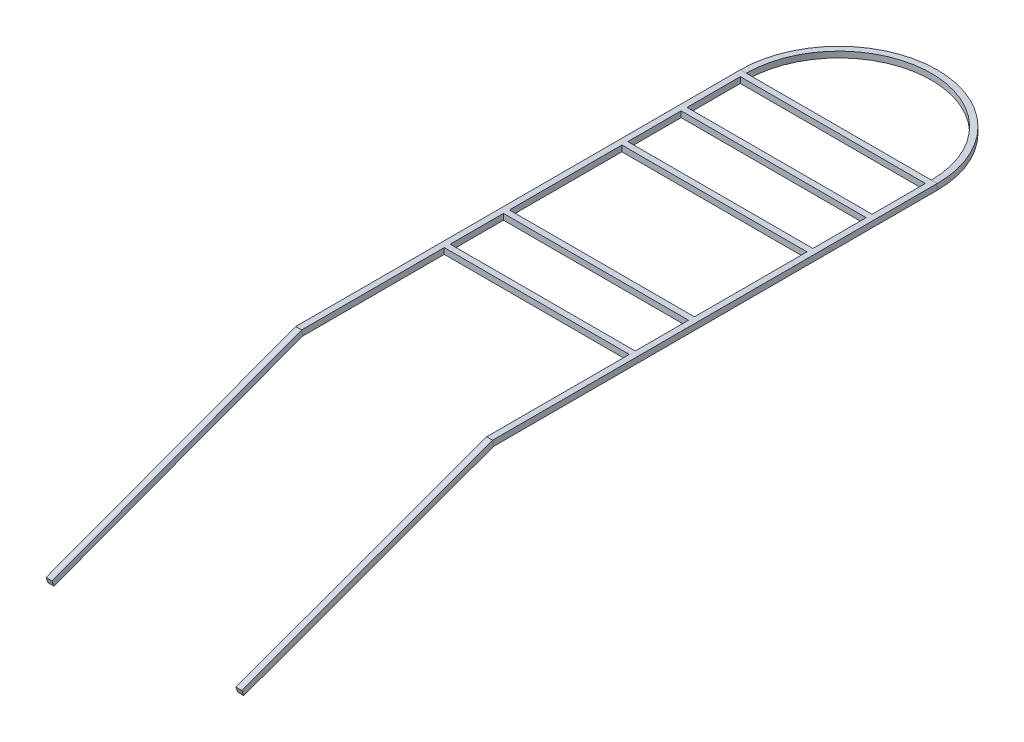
ISO-10303-21;
HEADER;
FILE_DESCRIPTION(('STEP AP214'),'2;1');
FILE_NAME('part.step','',(''),(''),'','','');
FILE_SCHEMA(('AUTOMOTIVE_DESIGN { 1 0 10303 214 1 1 1 1 }'));
ENDSEC;
DATA;
#1=APPLICATION_CONTEXT('core data for automotive mechanical design processes');
#2=APPLICATION_PROTOCOL_DEFINITION('international standard','automotive_design',2000,#1);
#3=PRODUCT_CONTEXT('',#1,'mechanical');
#4=PRODUCT('Part','Part','',(#3));
#5=PRODUCT_RELATED_PRODUCT_CATEGORY('part','',(#4));
#6=PRODUCT_DEFINITION_FORMATION('','',#4);
#7=PRODUCT_DEFINITION_CONTEXT('part definition',#1,'design');
#8=PRODUCT_DEFINITION('design','',#6,#7);
#9=PRODUCT_DEFINITION_SHAPE('','',#8);
#10=(LENGTH_UNIT() NAMED_UNIT(*) SI_UNIT(.MILLI.,.METRE.));
#11=(NAMED_UNIT(*) PLANE_ANGLE_UNIT() SI_UNIT($,.RADIAN.));
#12=(NAMED_UNIT(*) SI_UNIT($,.STERADIAN.) SOLID_ANGLE_UNIT());
#13=UNCERTAINTY_MEASURE_WITH_UNIT(LENGTH_MEASURE(1.E-05),#10,'distance_accuracy_value','');
#14=(GEOMETRIC_REPRESENTATION_CONTEXT(3) GLOBAL_UNCERTAINTY_ASSIGNED_CONTEXT((#13)) GLOBAL_UNIT_ASSIGNED_CONTEXT((#10,
#11,#12)) REPRESENTATION_CONTEXT('',''));
#15=CARTESIAN_POINT('',(0.,0.,0.));
#16=DIRECTION('',(0.,0.,1.));
#17=DIRECTION('',(1.,0.,0.));
#18=AXIS2_PLACEMENT_3D('',#15,#16,#17);
#19=CARTESIAN_POINT('',(-127.,-2.00000000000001,0.493089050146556));
#20=DIRECTION('',(1.,0.,0.));
#21=DIRECTION('',(0.,0.,-1.));
#22=AXIS2_PLACEMENT_3D('',#19,#20,#21);
#23=PLANE('',#22);
#24=DIRECTION('',(0.,0.,-1.));
#25=VECTOR('',#24,1.);
#26=CARTESIAN_POINT('',(-127.,-2.00000000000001,0.493089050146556));
#27=LINE('',#26,#25);
#28=CARTESIAN_POINT('',(-127.,-2.00000000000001,-0.357353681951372));
#29=VERTEX_POINT('',#28);
#30=CARTESIAN_POINT('',(-127.,-2.00000000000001,-95.9999999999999));
#31=VERTEX_POINT('',#30);
#32=EDGE_CURVE('E405',#29,#31,#27,.T.);
#33=ORIENTED_EDGE('',*,*,#32,.T.);
#34=DIRECTION('',(0.,-1.,0.));
#35=VECTOR('',#34,1.);
#36=CARTESIAN_POINT('',(-127.,-2.,-95.9999999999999));
#37=LINE('',#36,#35);
#38=CARTESIAN_POINT('',(-127.,2.,-95.9999999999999));
#39=VERTEX_POINT('',#38);
#40=EDGE_CURVE('E261',#39,#31,#37,.T.);
#41=ORIENTED_EDGE('',*,*,#40,.F.);
#42=DIRECTION('',(0.,0.,-1.));
#43=VECTOR('',#42,1.);
#44=CARTESIAN_POINT('',(-127.,2.,0.493089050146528));
#45=LINE('',#44,#43);
#46=CARTESIAN_POINT('',(-127.,2.,0.347950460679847));
#47=VERTEX_POINT('',#46);
#48=EDGE_CURVE('E400',#47,#39,#45,.T.);
#49=ORIENTED_EDGE('',*,*,#48,.F.);
#50=DIRECTION('',(0.,0.984807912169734,0.173647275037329));
#51=VECTOR('',#50,1.);
#52=CARTESIAN_POINT('',(-127.,-32.7208671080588,-5.77424239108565));
#53=LINE('',#52,#51);
#54=EDGE_CURVE('E48',#29,#47,#53,.T.);
#55=ORIENTED_EDGE('',*,*,#54,.F.);
#56=EDGE_LOOP('',(#33,#41,#49,#55));
#57=FACE_BOUND('',#56,.T.);
#58=ADVANCED_FACE('F39',(#57),#23,.T.);
#59=CARTESIAN_POINT('',(-127.,2.,-99.9999999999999));
#60=VERTEX_POINT('',#59);
#61=CARTESIAN_POINT('',(-127.,2.,-136.));
#62=VERTEX_POINT('',#61);
#63=EDGE_CURVE('E404',#60,#62,#45,.T.);
#64=ORIENTED_EDGE('',*,*,#63,.F.);
#65=DIRECTION('',(0.,1.,0.));
#66=VECTOR('',#65,1.);
#67=CARTESIAN_POINT('',(-127.,-2.,-99.9999999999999));
#68=LINE('',#67,#66);
#69=CARTESIAN_POINT('',(-127.,-2.,-99.9999999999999));
#70=VERTEX_POINT('',#69);
#71=EDGE_CURVE('E282',#70,#60,#68,.T.);
#72=ORIENTED_EDGE('',*,*,#71,.F.);
#73=CARTESIAN_POINT('',(-127.,-2.00000000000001,-136.));
#74=VERTEX_POINT('',#73);
#75=EDGE_CURVE('E408',#70,#74,#27,.T.);
#76=ORIENTED_EDGE('',*,*,#75,.T.);
#77=DIRECTION('',(0.,-1.,0.));
#78=VECTOR('',#77,1.);
#79=CARTESIAN_POINT('',(-127.,-2.,-136.));
#80=LINE('',#79,#78);
#81=EDGE_CURVE('E270',#62,#74,#80,.T.);
#82=ORIENTED_EDGE('',*,*,#81,.F.);
#83=EDGE_LOOP('',(#64,#72,#76,#82));
#84=FACE_BOUND('',#83,.T.);
#85=ADVANCED_FACE('F529',(#84),#23,.T.);
#86=CARTESIAN_POINT('',(-2.,-2.00000000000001,-300.));
#87=DIRECTION('',(-1.,0.,0.));
#88=DIRECTION('',(0.,-1.,0.));
#89=AXIS2_PLACEMENT_3D('',#86,#87,#88);
#90=PLANE('',#89);
#91=DIRECTION('',(0.,0.,1.));
#92=VECTOR('',#91,1.);
#93=CARTESIAN_POINT('',(-2.,2.,-300.));
#94=LINE('',#93,#92);
#95=CARTESIAN_POINT('',(-2.,2.,-95.9999999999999));
#96=VERTEX_POINT('',#95);
#97=CARTESIAN_POINT('',(-2.,2.,0.352653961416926));
#98=VERTEX_POINT('',#97);
#99=EDGE_CURVE('E56',#96,#98,#94,.T.);
#100=ORIENTED_EDGE('',*,*,#99,.F.);
#101=DIRECTION('',(0.,1.,0.));
#102=VECTOR('',#101,1.);
#103=CARTESIAN_POINT('',(-2.00000000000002,-2.,-95.9999999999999));
#104=LINE('',#103,#102);
#105=CARTESIAN_POINT('',(-2.00000000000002,-2.,-95.9999999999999));
#106=VERTEX_POINT('',#105);
#107=EDGE_CURVE('E254',#106,#96,#104,.T.);
#108=ORIENTED_EDGE('',*,*,#107,.F.);
#109=DIRECTION('',(0.,0.,1.));
#110=VECTOR('',#109,1.);
#111=CARTESIAN_POINT('',(-2.,-2.00000000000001,-300.));
#112=LINE('',#111,#110);
#113=CARTESIAN_POINT('',(-2.,-2.00000000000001,-0.352653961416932));
#114=VERTEX_POINT('',#113);
#115=EDGE_CURVE('E239',#106,#114,#112,.T.);
#116=ORIENTED_EDGE('',*,*,#115,.T.);
#117=DIRECTION('',(0.,0.984807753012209,0.173648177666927));
#118=VECTOR('',#117,1.);
#119=CARTESIAN_POINT('',(-2.,-53.2427141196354,-9.38812702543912));
#120=LINE('',#119,#118);
#121=EDGE_CURVE('E448',#114,#98,#120,.T.);
#122=ORIENTED_EDGE('',*,*,#121,.T.);
#123=EDGE_LOOP('',(#100,#108,#116,#122));
#124=FACE_BOUND('',#123,.T.);
#125=ADVANCED_FACE('F255',(#124),#90,.T.);
#126=CARTESIAN_POINT('',(-2.00000000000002,-2.,-136.));
#127=VERTEX_POINT('',#126);
#128=CARTESIAN_POINT('',(-2.,-2.00000000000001,-99.9999999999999));
#129=VERTEX_POINT('',#128);
#130=EDGE_CURVE('E249',#127,#129,#112,.T.);
#131=ORIENTED_EDGE('',*,*,#130,.T.);
#132=DIRECTION('',(0.,-1.,0.));
#133=VECTOR('',#132,1.);
#134=CARTESIAN_POINT('',(-2.00000000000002,-2.,-99.9999999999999));
#135=LINE('',#134,#133);
#136=CARTESIAN_POINT('',(-2.,2.,-99.9999999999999));
#137=VERTEX_POINT('',#136);
#138=EDGE_CURVE('E64',#137,#129,#135,.T.);
#139=ORIENTED_EDGE('',*,*,#138,.F.);
#140=CARTESIAN_POINT('',(-2.,2.,-136.));
#141=VERTEX_POINT('',#140);
#142=EDGE_CURVE('E579',#141,#137,#94,.T.);
#143=ORIENTED_EDGE('',*,*,#142,.F.);
#144=DIRECTION('',(0.,1.,0.));
#145=VECTOR('',#144,1.);
#146=CARTESIAN_POINT('',(-2.00000000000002,-2.,-136.));
#147=LINE('',#146,#145);
#148=EDGE_CURVE('E281',#127,#141,#147,.T.);
#149=ORIENTED_EDGE('',*,*,#148,.F.);
#150=EDGE_LOOP('',(#131,#139,#143,#149));
#151=FACE_BOUND('',#150,.T.);
#152=ADVANCED_FACE('F559',(#151),#90,.T.);
#153=CARTESIAN_POINT('',(-127.,2.,-140.));
#154=VERTEX_POINT('',#153);
#155=CARTESIAN_POINT('',(-127.,2.,-216.));
#156=VERTEX_POINT('',#155);
#157=EDGE_CURVE('E567',#154,#156,#45,.T.);
#158=ORIENTED_EDGE('',*,*,#157,.F.);
#159=DIRECTION('',(0.,1.,0.));
#160=VECTOR('',#159,1.);
#161=CARTESIAN_POINT('',(-127.,-2.,-140.));
#162=LINE('',#161,#160);
#163=CARTESIAN_POINT('',(-127.,-2.,-140.));
#164=VERTEX_POINT('',#163);
#165=EDGE_CURVE('E273',#164,#154,#162,.T.);
#166=ORIENTED_EDGE('',*,*,#165,.F.);
#167=CARTESIAN_POINT('',(-127.,-2.00000000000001,-216.));
#168=VERTEX_POINT('',#167);
#169=EDGE_CURVE('E900',#164,#168,#27,.T.);
#170=ORIENTED_EDGE('',*,*,#169,.T.);
#171=DIRECTION('',(0.,-1.,0.));
#172=VECTOR('',#171,1.);
#173=CARTESIAN_POINT('',(-127.,-2.,-216.));
#174=LINE('',#173,#172);
#175=EDGE_CURVE('E296',#156,#168,#174,.T.);
#176=ORIENTED_EDGE('',*,*,#175,.F.);
#177=EDGE_LOOP('',(#158,#166,#170,#176));
#178=FACE_BOUND('',#177,.T.);
#179=ADVANCED_FACE('F537',(#178),#23,.T.);
#180=CARTESIAN_POINT('',(-2.00000000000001,-2.,-216.));
#181=VERTEX_POINT('',#180);
#182=CARTESIAN_POINT('',(-2.,-2.00000000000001,-140.));
#183=VERTEX_POINT('',#182);
#184=EDGE_CURVE('E905',#181,#183,#112,.T.);
#185=ORIENTED_EDGE('',*,*,#184,.T.);
#186=DIRECTION('',(0.,-1.,0.));
#187=VECTOR('',#186,1.);
#188=CARTESIAN_POINT('',(-2.00000000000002,-2.,-140.));
#189=LINE('',#188,#187);
#190=CARTESIAN_POINT('',(-2.,2.,-140.));
#191=VERTEX_POINT('',#190);
#192=EDGE_CURVE('E278',#191,#183,#189,.T.);
#193=ORIENTED_EDGE('',*,*,#192,.F.);
#194=CARTESIAN_POINT('',(-2.,2.,-216.));
#195=VERTEX_POINT('',#194);
#196=EDGE_CURVE('E577',#195,#191,#94,.T.);
#197=ORIENTED_EDGE('',*,*,#196,.F.);
#198=DIRECTION('',(0.,1.,0.));
#199=VECTOR('',#198,1.);
#200=CARTESIAN_POINT('',(-2.00000000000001,-2.,-216.));
#201=LINE('',#200,#199);
#202=EDGE_CURVE('E306',#181,#195,#201,.T.);
#203=ORIENTED_EDGE('',*,*,#202,.F.);
#204=EDGE_LOOP('',(#185,#193,#197,#203));
#205=FACE_BOUND('',#204,.T.);
#206=ADVANCED_FACE('F552',(#205),#90,.T.);
#207=CARTESIAN_POINT('',(-127.,2.,-220.));
#208=VERTEX_POINT('',#207);
#209=CARTESIAN_POINT('',(-127.,2.,-256.));
#210=VERTEX_POINT('',#209);
#211=EDGE_CURVE('E572',#208,#210,#45,.T.);
#212=ORIENTED_EDGE('',*,*,#211,.F.);
#213=DIRECTION('',(0.,1.,0.));
#214=VECTOR('',#213,1.);
#215=CARTESIAN_POINT('',(-127.,-2.,-220.));
#216=LINE('',#215,#214);
#217=CARTESIAN_POINT('',(-127.,-2.,-220.));
#218=VERTEX_POINT('',#217);
#219=EDGE_CURVE('E299',#218,#208,#216,.T.);
#220=ORIENTED_EDGE('',*,*,#219,.F.);
#221=CARTESIAN_POINT('',(-127.,-2.00000000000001,-256.));
#222=VERTEX_POINT('',#221);
#223=EDGE_CURVE('E911',#218,#222,#27,.T.);
#224=ORIENTED_EDGE('',*,*,#223,.T.);
#225=DIRECTION('',(0.,-1.,0.));
#226=VECTOR('',#225,1.);
#227=CARTESIAN_POINT('',(-127.,-1.99999999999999,-256.));
#228=LINE('',#227,#226);
#229=EDGE_CURVE('E320',#210,#222,#228,.T.);
#230=ORIENTED_EDGE('',*,*,#229,.F.);
#231=EDGE_LOOP('',(#212,#220,#224,#230));
#232=FACE_BOUND('',#231,.T.);
#233=ADVANCED_FACE('F544',(#232),#23,.T.);
#234=CARTESIAN_POINT('',(-2.,-2.,-256.));
#235=VERTEX_POINT('',#234);
#236=CARTESIAN_POINT('',(-2.,-2.00000000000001,-220.));
#237=VERTEX_POINT('',#236);
#238=EDGE_CURVE('E460',#235,#237,#112,.T.);
#239=ORIENTED_EDGE('',*,*,#238,.T.);
#240=DIRECTION('',(0.,-1.,0.));
#241=VECTOR('',#240,1.);
#242=CARTESIAN_POINT('',(-2.00000000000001,-2.,-220.));
#243=LINE('',#242,#241);
#244=CARTESIAN_POINT('',(-2.,2.,-220.));
#245=VERTEX_POINT('',#244);
#246=EDGE_CURVE('E277',#245,#237,#243,.T.);
#247=ORIENTED_EDGE('',*,*,#246,.F.);
#248=CARTESIAN_POINT('',(-2.,2.,-256.));
#249=VERTEX_POINT('',#248);
#250=EDGE_CURVE('E458',#249,#245,#94,.T.);
#251=ORIENTED_EDGE('',*,*,#250,.F.);
#252=DIRECTION('',(0.,1.,0.));
#253=VECTOR('',#252,1.);
#254=CARTESIAN_POINT('',(-2.,-2.,-256.));
#255=LINE('',#254,#253);
#256=EDGE_CURVE('E330',#235,#249,#255,.T.);
#257=ORIENTED_EDGE('',*,*,#256,.F.);
#258=EDGE_LOOP('',(#239,#247,#251,#257));
#259=FACE_BOUND('',#258,.T.);
#260=ADVANCED_FACE('F542',(#259),#90,.T.);
#261=CARTESIAN_POINT('',(-127.,2.,-260.));
#262=VERTEX_POINT('',#261);
#263=CARTESIAN_POINT('',(-127.,2.00000000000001,-296.));
#264=VERTEX_POINT('',#263);
#265=EDGE_CURVE('E399',#262,#264,#45,.T.);
#266=ORIENTED_EDGE('',*,*,#265,.F.);
#267=DIRECTION('',(0.,1.,0.));
#268=VECTOR('',#267,1.);
#269=CARTESIAN_POINT('',(-127.,-2.,-260.));
#270=LINE('',#269,#268);
#271=CARTESIAN_POINT('',(-127.,-2.,-260.));
#272=VERTEX_POINT('',#271);
#273=EDGE_CURVE('E323',#272,#262,#270,.T.);
#274=ORIENTED_EDGE('',*,*,#273,.F.);
#275=CARTESIAN_POINT('',(-127.,-2.,-296.));
#276=VERTEX_POINT('',#275);
#277=EDGE_CURVE('E403',#272,#276,#27,.T.);
#278=ORIENTED_EDGE('',*,*,#277,.T.);
#279=DIRECTION('',(0.,-1.,0.));
#280=VECTOR('',#279,1.);
#281=CARTESIAN_POINT('',(-127.,-1.99999999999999,-296.));
#282=LINE('',#281,#280);
#283=EDGE_CURVE('E344',#264,#276,#282,.T.);
#284=ORIENTED_EDGE('',*,*,#283,.F.);
#285=EDGE_LOOP('',(#266,#274,#278,#284));
#286=FACE_BOUND('',#285,.T.);
#287=ADVANCED_FACE('F532',(#286),#23,.T.);
#288=CARTESIAN_POINT('',(-2.,-2.,-296.));
#289=VERTEX_POINT('',#288);
#290=CARTESIAN_POINT('',(-2.,-2.00000000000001,-260.));
#291=VERTEX_POINT('',#290);
#292=EDGE_CURVE('E252',#289,#291,#112,.T.);
#293=ORIENTED_EDGE('',*,*,#292,.T.);
#294=DIRECTION('',(0.,-1.,0.));
#295=VECTOR('',#294,1.);
#296=CARTESIAN_POINT('',(-2.,-2.,-260.));
#297=LINE('',#296,#295);
#298=CARTESIAN_POINT('',(-2.,2.,-260.));
#299=VERTEX_POINT('',#298);
#300=EDGE_CURVE('E303',#299,#291,#297,.T.);
#301=ORIENTED_EDGE('',*,*,#300,.F.);
#302=CARTESIAN_POINT('',(-2.,2.,-296.));
#303=VERTEX_POINT('',#302);
#304=EDGE_CURVE('E250',#303,#299,#94,.T.);
#305=ORIENTED_EDGE('',*,*,#304,.F.);
#306=DIRECTION('',(0.,1.,0.));
#307=VECTOR('',#306,1.);
#308=CARTESIAN_POINT('',(-2.,-2.,-296.));
#309=LINE('',#308,#307);
#310=EDGE_CURVE('E327',#289,#303,#309,.T.);
#311=ORIENTED_EDGE('',*,*,#310,.F.);
#312=EDGE_LOOP('',(#293,#301,#305,#311));
#313=FACE_BOUND('',#312,.T.);
#314=ADVANCED_FACE('F541',(#313),#90,.T.);
#315=CARTESIAN_POINT('',(0.,-61.5636257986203,169.144671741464));
#316=DIRECTION('',(0.,0.342020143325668,-0.939692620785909));
#317=DIRECTION('',(0.,0.939692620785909,0.342020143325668));
#318=AXIS2_PLACEMENT_3D('',#315,#316,#317);
#319=PLANE('',#318);
#320=DIRECTION('',(0.,0.939692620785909,0.342020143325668));
#321=VECTOR('',#320,1.);
#322=CARTESIAN_POINT('',(1.99999999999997,-63.4430110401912,168.460631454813));
#323=LINE('',#322,#321);
#324=CARTESIAN_POINT('',(1.99999999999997,-63.4430110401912,168.460631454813));
#325=VERTEX_POINT('',#324);
#326=CARTESIAN_POINT('',(1.99999999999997,-59.6842405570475,169.828712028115));
#327=VERTEX_POINT('',#326);
#328=EDGE_CURVE('E466',#325,#327,#323,.T.);
#329=ORIENTED_EDGE('',*,*,#328,.T.);
#330=DIRECTION('',(-1.,0.,0.));
#331=VECTOR('',#330,1.);
#332=CARTESIAN_POINT('',(-2.00000000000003,-59.6842405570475,169.828712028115));
#333=LINE('',#332,#331);
#334=CARTESIAN_POINT('',(-2.00000000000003,-59.6842405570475,169.828712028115));
#335=VERTEX_POINT('',#334);
#336=EDGE_CURVE('E464',#327,#335,#333,.T.);
#337=ORIENTED_EDGE('',*,*,#336,.T.);
#338=DIRECTION('',(0.,-0.939692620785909,-0.342020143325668));
#339=VECTOR('',#338,1.);
#340=CARTESIAN_POINT('',(-2.00000000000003,-63.4430110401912,168.460631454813));
#341=LINE('',#340,#339);
#342=CARTESIAN_POINT('',(-2.00000000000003,-63.4430110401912,168.460631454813));
#343=VERTEX_POINT('',#342);
#344=EDGE_CURVE('E462',#335,#343,#341,.T.);
#345=ORIENTED_EDGE('',*,*,#344,.T.);
#346=DIRECTION('',(1.,0.,0.));
#347=VECTOR('',#346,1.);
#348=CARTESIAN_POINT('',(-2.00000000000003,-63.4430110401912,168.460631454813));
#349=LINE('',#348,#347);
#350=EDGE_CURVE('E347',#343,#325,#349,.T.);
#351=ORIENTED_EDGE('',*,*,#350,.T.);
#352=EDGE_LOOP('',(#329,#337,#345,#351));
#353=FACE_BOUND('',#352,.T.);
#354=ADVANCED_FACE('F41',(#353),#319,.F.);
#355=CARTESIAN_POINT('',(-128.179224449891,-61.5636257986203,169.144671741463));
#356=DIRECTION('',(0.00455981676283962,-0.342016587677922,0.939682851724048));
#357=DIRECTION('',(0.000804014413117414,0.939693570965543,0.342016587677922));
#358=AXIS2_PLACEMENT_3D('',#355,#356,#357);
#359=PLANE('',#358);
#360=DIRECTION('',(0.000804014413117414,0.939693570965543,0.342016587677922));
#361=VECTOR('',#360,1.);
#362=CARTESIAN_POINT('',(-130.180811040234,-63.4446209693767,168.469758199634));
#363=LINE('',#362,#361);
#364=CARTESIAN_POINT('',(-130.180811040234,-63.4446209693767,168.469758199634));
#365=VERTEX_POINT('',#364);
#366=CARTESIAN_POINT('',(-130.177594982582,-59.6858466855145,169.837824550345));
#367=VERTEX_POINT('',#366);
#368=EDGE_CURVE('E368',#365,#367,#363,.T.);
#369=ORIENTED_EDGE('',*,*,#368,.F.);
#370=DIRECTION('',(-0.999989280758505,-0.000804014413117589,0.00455981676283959));
#371=VECTOR('',#370,1.);
#372=CARTESIAN_POINT('',(-126.1808539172,-63.4414049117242,168.451518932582));
#373=LINE('',#372,#371);
#374=CARTESIAN_POINT('',(-126.1808539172,-63.4414049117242,168.451518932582));
#375=VERTEX_POINT('',#374);
#376=EDGE_CURVE('E379',#375,#365,#373,.T.);
#377=ORIENTED_EDGE('',*,*,#376,.F.);
#378=DIRECTION('',(-0.000804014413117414,-0.939693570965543,-0.342016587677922));
#379=VECTOR('',#378,1.);
#380=CARTESIAN_POINT('',(-126.1808539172,-63.4414049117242,168.451518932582));
#381=LINE('',#380,#379);
#382=CARTESIAN_POINT('',(-126.177637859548,-59.682630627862,169.819585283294));
#383=VERTEX_POINT('',#382);
#384=EDGE_CURVE('E382',#383,#375,#381,.T.);
#385=ORIENTED_EDGE('',*,*,#384,.F.);
#386=DIRECTION('',(0.999989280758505,0.000804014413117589,-0.00455981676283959));
#387=VECTOR('',#386,1.);
#388=CARTESIAN_POINT('',(-126.177637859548,-59.682630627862,169.819585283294));
#389=LINE('',#388,#387);
#390=EDGE_CURVE('E371',#367,#383,#389,.T.);
#391=ORIENTED_EDGE('',*,*,#390,.F.);
#392=EDGE_LOOP('',(#369,#377,#385,#391));
#393=FACE_BOUND('',#392,.T.);
#394=ADVANCED_FACE('F594',(#393),#359,.T.);
#395=CARTESIAN_POINT('',(2.,-1.71250699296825,-1.1425345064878));
#396=DIRECTION('',(1.,0.,0.));
#397=DIRECTION('',(0.,0.,-1.));
#398=AXIS2_PLACEMENT_3D('',#395,#396,#397);
#399=PLANE('',#398);
#400=DIRECTION('',(0.,-0.984807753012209,-0.173648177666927));
#401=VECTOR('',#400,1.);
#402=CARTESIAN_POINT('',(2.,-53.2427141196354,-9.38812702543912));
#403=LINE('',#402,#401);
#404=CARTESIAN_POINT('',(2.,2.,0.352653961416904));
#405=VERTEX_POINT('',#404);
#406=CARTESIAN_POINT('',(2.,-2.00000000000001,-0.352653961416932));
#407=VERTEX_POINT('',#406);
#408=EDGE_CURVE('E397',#405,#407,#403,.T.);
#409=ORIENTED_EDGE('',*,*,#408,.F.);
#410=DIRECTION('',(0.,-0.342020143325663,0.93969262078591));
#411=VECTOR('',#410,1.);
#412=CARTESIAN_POINT('',(2.,2.04626349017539,0.22554606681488));
#413=LINE('',#412,#411);
#414=EDGE_CURVE('E473',#405,#327,#413,.T.);
#415=ORIENTED_EDGE('',*,*,#414,.T.);
#416=ORIENTED_EDGE('',*,*,#328,.F.);
#417=DIRECTION('',(0.,-0.342020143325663,0.93969262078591));
#418=VECTOR('',#417,1.);
#419=CARTESIAN_POINT('',(2.,-1.71250699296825,-1.1425345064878));
#420=LINE('',#419,#418);
#421=EDGE_CURVE('E43',#407,#325,#420,.T.);
#422=ORIENTED_EDGE('',*,*,#421,.F.);
#423=EDGE_LOOP('',(#409,#415,#416,#422));
#424=FACE_BOUND('',#423,.T.);
#425=ADVANCED_FACE('F484',(#424),#399,.T.);
#426=CARTESIAN_POINT('',(-2.,2.04626349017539,0.22554606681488));
#427=DIRECTION('',(0.,0.939692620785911,0.342020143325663));
#428=DIRECTION('',(0.,-0.342020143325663,0.939692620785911));
#429=AXIS2_PLACEMENT_3D('',#426,#427,#428);
#430=PLANE('',#429);
#431=DIRECTION('',(1.,0.,0.));
#432=VECTOR('',#431,1.);
#433=CARTESIAN_POINT('',(-2.00000000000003,2.,0.352653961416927));
#434=LINE('',#433,#432);
#435=EDGE_CURVE('E450',#98,#405,#434,.T.);
#436=ORIENTED_EDGE('',*,*,#435,.F.);
#437=DIRECTION('',(0.,-0.342020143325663,0.93969262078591));
#438=VECTOR('',#437,1.);
#439=CARTESIAN_POINT('',(-2.,2.04626349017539,0.22554606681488));
#440=LINE('',#439,#438);
#441=EDGE_CURVE('E471',#98,#335,#440,.T.);
#442=ORIENTED_EDGE('',*,*,#441,.T.);
#443=ORIENTED_EDGE('',*,*,#336,.F.);
#444=ORIENTED_EDGE('',*,*,#414,.F.);
#445=EDGE_LOOP('',(#436,#442,#443,#444));
#446=FACE_BOUND('',#445,.T.);
#447=ADVANCED_FACE('F587',(#446),#430,.T.);
#448=CARTESIAN_POINT('',(-2.,-1.71250699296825,-1.1425345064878));
#449=DIRECTION('',(-1.,0.,0.));
#450=DIRECTION('',(0.,0.,1.));
#451=AXIS2_PLACEMENT_3D('',#448,#449,#450);
#452=PLANE('',#451);
#453=ORIENTED_EDGE('',*,*,#121,.F.);
#454=DIRECTION('',(0.,-0.342020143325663,0.93969262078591));
#455=VECTOR('',#454,1.);
#456=CARTESIAN_POINT('',(-2.,-1.71250699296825,-1.1425345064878));
#457=LINE('',#456,#455);
#458=EDGE_CURVE('E468',#114,#343,#457,.T.);
#459=ORIENTED_EDGE('',*,*,#458,.T.);
#460=ORIENTED_EDGE('',*,*,#344,.F.);
#461=ORIENTED_EDGE('',*,*,#441,.F.);
#462=EDGE_LOOP('',(#453,#459,#460,#461));
#463=FACE_BOUND('',#462,.T.);
#464=ADVANCED_FACE('F591',(#463),#452,.T.);
#465=CARTESIAN_POINT('',(-2.,-1.71250699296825,-1.1425345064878));
#466=DIRECTION('',(0.,-0.939692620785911,-0.342020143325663));
#467=DIRECTION('',(0.,0.342020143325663,-0.939692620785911));
#468=AXIS2_PLACEMENT_3D('',#465,#466,#467);
#469=PLANE('',#468);
#470=DIRECTION('',(-1.,0.,0.));
#471=VECTOR('',#470,1.);
#472=CARTESIAN_POINT('',(-2.00000000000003,-2.00000000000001,-0.352653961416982));
#473=LINE('',#472,#471);
#474=EDGE_CURVE('E247',#407,#114,#473,.T.);
#475=ORIENTED_EDGE('',*,*,#474,.F.);
#476=ORIENTED_EDGE('',*,*,#421,.T.);
#477=ORIENTED_EDGE('',*,*,#350,.F.);
#478=ORIENTED_EDGE('',*,*,#458,.F.);
#479=EDGE_LOOP('',(#475,#476,#477,#478));
#480=FACE_BOUND('',#479,.T.);
#481=ADVANCED_FACE('F482',(#480),#469,.T.);
#482=CARTESIAN_POINT('',(-131.,-2.00000000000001,0.493089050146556));
#483=DIRECTION('',(-1.,0.,0.));
#484=DIRECTION('',(0.,0.,1.));
#485=AXIS2_PLACEMENT_3D('',#482,#483,#484);
#486=PLANE('',#485);
#487=DIRECTION('',(0.,-0.984807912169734,-0.173647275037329));
#488=VECTOR('',#487,1.);
#489=CARTESIAN_POINT('',(-131.,-32.7224751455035,-5.76512270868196));
#490=LINE('',#489,#488);
#491=CARTESIAN_POINT('',(-131.,2.00000000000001,0.357353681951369));
#492=VERTEX_POINT('',#491);
#493=CARTESIAN_POINT('',(-131.,-2.00000000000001,-0.347950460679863));
#494=VERTEX_POINT('',#493);
#495=EDGE_CURVE('E367',#492,#494,#490,.T.);
#496=ORIENTED_EDGE('',*,*,#495,.F.);
#497=DIRECTION('',(0.,0.,-1.));
#498=VECTOR('',#497,1.);
#499=CARTESIAN_POINT('',(-131.,2.,0.493089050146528));
#500=LINE('',#499,#498);
#501=CARTESIAN_POINT('',(-131.,2.,-300.));
#502=VERTEX_POINT('',#501);
#503=EDGE_CURVE('E396',#492,#502,#500,.T.);
#504=ORIENTED_EDGE('',*,*,#503,.T.);
#505=DIRECTION('',(0.,1.,0.));
#506=VECTOR('',#505,1.);
#507=CARTESIAN_POINT('',(-131.,-2.00000000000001,-300.));
#508=LINE('',#507,#506);
#509=CARTESIAN_POINT('',(-131.,-2.00000000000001,-300.));
#510=VERTEX_POINT('',#509);
#511=EDGE_CURVE('E407',#510,#502,#508,.T.);
#512=ORIENTED_EDGE('',*,*,#511,.F.);
#513=DIRECTION('',(0.,0.,-1.));
#514=VECTOR('',#513,1.);
#515=CARTESIAN_POINT('',(-131.,-2.00000000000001,0.493089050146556));
#516=LINE('',#515,#514);
#517=EDGE_CURVE('E394',#494,#510,#516,.T.);
#518=ORIENTED_EDGE('',*,*,#517,.F.);
#519=EDGE_LOOP('',(#496,#504,#512,#518));
#520=FACE_BOUND('',#519,.T.);
#521=ADVANCED_FACE('F499',(#520),#486,.T.);
#522=CARTESIAN_POINT('',(-64.5,0.,-300.));
#523=DIRECTION('',(0.,-1.,0.));
#524=DIRECTION('',(0.,0.,-1.));
#525=AXIS2_PLACEMENT_3D('',#522,#523,#524);
#526=CYLINDRICAL_SURFACE('',#525,66.5);
#527=CARTESIAN_POINT('',(-64.5,2.,-300.));
#528=DIRECTION('',(0.,-1.,0.));
#529=DIRECTION('',(-1.,0.,0.));
#530=AXIS2_PLACEMENT_3D('',#527,#528,#529);
#531=CIRCLE('',#530,66.5);
#532=CARTESIAN_POINT('',(2.,2.,-300.));
#533=VERTEX_POINT('',#532);
#534=EDGE_CURVE('E415',#502,#533,#531,.T.);
#535=ORIENTED_EDGE('',*,*,#534,.T.);
#536=DIRECTION('',(0.,1.,0.));
#537=VECTOR('',#536,1.);
#538=CARTESIAN_POINT('',(2.,-2.00000000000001,-300.));
#539=LINE('',#538,#537);
#540=CARTESIAN_POINT('',(2.,-2.00000000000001,-300.));
#541=VERTEX_POINT('',#540);
#542=EDGE_CURVE('E412',#541,#533,#539,.T.);
#543=ORIENTED_EDGE('',*,*,#542,.F.);
#544=CARTESIAN_POINT('',(-64.5,-2.00000000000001,-300.));
#545=DIRECTION('',(0.,-1.,0.));
#546=DIRECTION('',(-1.,0.,0.));
#547=AXIS2_PLACEMENT_3D('',#544,#545,#546);
#548=CIRCLE('',#547,66.5);
#549=EDGE_CURVE('E416',#510,#541,#548,.T.);
#550=ORIENTED_EDGE('',*,*,#549,.F.);
#551=ORIENTED_EDGE('',*,*,#511,.T.);
#552=EDGE_LOOP('',(#535,#543,#550,#551));
#553=FACE_BOUND('',#552,.T.);
#554=ADVANCED_FACE('F493',(#553),#526,.T.);
#555=CARTESIAN_POINT('',(-127.,2.,-300.));
#556=DIRECTION('',(0.,1.,0.));
#557=DIRECTION('',(0.,0.,1.));
#558=AXIS2_PLACEMENT_3D('',#555,#556,#557);
#559=PLANE('',#558);
#560=CARTESIAN_POINT('',(-64.5,2.,-300.));
#561=DIRECTION('',(0.,-1.,0.));
#562=DIRECTION('',(-1.,0.,0.));
#563=AXIS2_PLACEMENT_3D('',#560,#561,#562);
#564=CIRCLE('',#563,62.5);
#565=CARTESIAN_POINT('',(-127.,2.00000000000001,-300.));
#566=VERTEX_POINT('',#565);
#567=CARTESIAN_POINT('',(-2.,2.,-300.));
#568=VERTEX_POINT('',#567);
#569=EDGE_CURVE('E428',#566,#568,#564,.T.);
#570=ORIENTED_EDGE('',*,*,#569,.T.);
#571=DIRECTION('',(-1.,0.,0.));
#572=VECTOR('',#571,1.);
#573=CARTESIAN_POINT('',(-2.,2.,-300.));
#574=LINE('',#573,#572);
#575=EDGE_CURVE('E419',#533,#568,#574,.T.);
#576=ORIENTED_EDGE('',*,*,#575,.F.);
#577=ORIENTED_EDGE('',*,*,#534,.F.);
#578=DIRECTION('',(1.,0.,0.));
#579=VECTOR('',#578,1.);
#580=CARTESIAN_POINT('',(-127.,2.,-300.));
#581=LINE('',#580,#579);
#582=EDGE_CURVE('E411',#502,#566,#581,.T.);
#583=ORIENTED_EDGE('',*,*,#582,.T.);
#584=EDGE_LOOP('',(#570,#576,#577,#583));
#585=FACE_BOUND('',#584,.T.);
#586=ADVANCED_FACE('F505',(#585),#559,.T.);
#587=CARTESIAN_POINT('',(-64.5,0.,-300.));
#588=DIRECTION('',(0.,-1.,0.));
#589=DIRECTION('',(0.,0.,-1.));
#590=AXIS2_PLACEMENT_3D('',#587,#588,#589);
#591=CYLINDRICAL_SURFACE('',#590,62.5);
#592=CARTESIAN_POINT('',(-64.5,-2.00000000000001,-300.));
#593=DIRECTION('',(0.,-1.,0.));
#594=DIRECTION('',(-1.,0.,0.));
#595=AXIS2_PLACEMENT_3D('',#592,#593,#594);
#596=CIRCLE('',#595,62.5);
#597=CARTESIAN_POINT('',(-127.,-2.00000000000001,-300.));
#598=VERTEX_POINT('',#597);
#599=CARTESIAN_POINT('',(-2.,-2.00000000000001,-300.));
#600=VERTEX_POINT('',#599);
#601=EDGE_CURVE('E436',#598,#600,#596,.T.);
#602=ORIENTED_EDGE('',*,*,#601,.T.);
#603=DIRECTION('',(0.,-1.,0.));
#604=VECTOR('',#603,1.);
#605=CARTESIAN_POINT('',(-2.,-2.00000000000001,-300.));
#606=LINE('',#605,#604);
#607=EDGE_CURVE('E431',#568,#600,#606,.T.);
#608=ORIENTED_EDGE('',*,*,#607,.F.);
#609=ORIENTED_EDGE('',*,*,#569,.F.);
#610=DIRECTION('',(0.,-1.,0.));
#611=VECTOR('',#610,1.);
#612=CARTESIAN_POINT('',(-127.,-2.00000000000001,-300.));
#613=LINE('',#612,#611);
#614=EDGE_CURVE('E425',#566,#598,#613,.T.);
#615=ORIENTED_EDGE('',*,*,#614,.T.);
#616=EDGE_LOOP('',(#602,#608,#609,#615));
#617=FACE_BOUND('',#616,.T.);
#618=ADVANCED_FACE('F511',(#617),#591,.F.);
#619=CARTESIAN_POINT('',(-127.,-2.00000000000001,-300.));
#620=DIRECTION('',(0.,-1.,0.));
#621=DIRECTION('',(0.,0.,-1.));
#622=AXIS2_PLACEMENT_3D('',#619,#620,#621);
#623=PLANE('',#622);
#624=DIRECTION('',(1.,0.,0.));
#625=VECTOR('',#624,1.);
#626=CARTESIAN_POINT('',(-2.,-2.00000000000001,-300.));
#627=LINE('',#626,#625);
#628=EDGE_CURVE('E439',#600,#541,#627,.T.);
#629=ORIENTED_EDGE('',*,*,#628,.F.);
#630=ORIENTED_EDGE('',*,*,#601,.F.);
#631=DIRECTION('',(-1.,0.,0.));
#632=VECTOR('',#631,1.);
#633=CARTESIAN_POINT('',(-127.,-2.00000000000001,-300.));
#634=LINE('',#633,#632);
#635=EDGE_CURVE('E422',#598,#510,#634,.T.);
#636=ORIENTED_EDGE('',*,*,#635,.T.);
#637=ORIENTED_EDGE('',*,*,#549,.T.);
#638=EDGE_LOOP('',(#629,#630,#636,#637));
#639=FACE_BOUND('',#638,.T.);
#640=ADVANCED_FACE('F495',(#639),#623,.T.);
#641=CARTESIAN_POINT('',(2.,-2.00000000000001,-300.));
#642=DIRECTION('',(1.,0.,0.));
#643=DIRECTION('',(0.,1.,0.));
#644=AXIS2_PLACEMENT_3D('',#641,#642,#643);
#645=PLANE('',#644);
#646=DIRECTION('',(0.,0.,1.));
#647=VECTOR('',#646,1.);
#648=CARTESIAN_POINT('',(2.,2.,-300.));
#649=LINE('',#648,#647);
#650=EDGE_CURVE('E454',#533,#405,#649,.T.);
#651=ORIENTED_EDGE('',*,*,#650,.T.);
#652=ORIENTED_EDGE('',*,*,#408,.T.);
#653=DIRECTION('',(0.,0.,1.));
#654=VECTOR('',#653,1.);
#655=CARTESIAN_POINT('',(2.,-2.00000000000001,-300.));
#656=LINE('',#655,#654);
#657=EDGE_CURVE('E444',#541,#407,#656,.T.);
#658=ORIENTED_EDGE('',*,*,#657,.F.);
#659=ORIENTED_EDGE('',*,*,#542,.T.);
#660=EDGE_LOOP('',(#651,#652,#658,#659));
#661=FACE_BOUND('',#660,.T.);
#662=ADVANCED_FACE('F486',(#661),#645,.T.);
#663=CARTESIAN_POINT('',(-2.,2.,-300.));
#664=DIRECTION('',(0.,1.,0.));
#665=DIRECTION('',(-1.,0.,0.));
#666=AXIS2_PLACEMENT_3D('',#663,#664,#665);
#667=PLANE('',#666);
#668=ORIENTED_EDGE('',*,*,#142,.T.);
#669=DIRECTION('',(1.,0.,0.));
#670=VECTOR('',#669,1.);
#671=CARTESIAN_POINT('',(-132.656854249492,2.,-99.9999999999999));
#672=LINE('',#671,#670);
#673=EDGE_CURVE('E258',#60,#137,#672,.T.);
#674=ORIENTED_EDGE('',*,*,#673,.F.);
#675=ORIENTED_EDGE('',*,*,#63,.T.);
#676=DIRECTION('',(1.,0.,0.));
#677=VECTOR('',#676,1.);
#678=CARTESIAN_POINT('',(-132.656854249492,2.,-136.));
#679=LINE('',#678,#677);
#680=EDGE_CURVE('E288',#62,#141,#679,.T.);
#681=ORIENTED_EDGE('',*,*,#680,.T.);
#682=EDGE_LOOP('',(#668,#674,#675,#681));
#683=FACE_BOUND('',#682,.T.);
#684=ORIENTED_EDGE('',*,*,#196,.T.);
#685=DIRECTION('',(1.,0.,0.));
#686=VECTOR('',#685,1.);
#687=CARTESIAN_POINT('',(-132.656854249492,2.,-140.));
#688=LINE('',#687,#686);
#689=EDGE_CURVE('E285',#154,#191,#688,.T.);
#690=ORIENTED_EDGE('',*,*,#689,.F.);
#691=ORIENTED_EDGE('',*,*,#157,.T.);
#692=DIRECTION('',(1.,0.,0.));
#693=VECTOR('',#692,1.);
#694=CARTESIAN_POINT('',(-132.656854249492,2.,-216.));
#695=LINE('',#694,#693);
#696=EDGE_CURVE('E312',#156,#195,#695,.T.);
#697=ORIENTED_EDGE('',*,*,#696,.T.);
#698=EDGE_LOOP('',(#684,#690,#691,#697));
#699=FACE_BOUND('',#698,.T.);
#700=ORIENTED_EDGE('',*,*,#250,.T.);
#701=DIRECTION('',(1.,0.,0.));
#702=VECTOR('',#701,1.);
#703=CARTESIAN_POINT('',(-132.656854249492,2.,-220.));
#704=LINE('',#703,#702);
#705=EDGE_CURVE('E309',#208,#245,#704,.T.);
#706=ORIENTED_EDGE('',*,*,#705,.F.);
#707=ORIENTED_EDGE('',*,*,#211,.T.);
#708=DIRECTION('',(1.,0.,0.));
#709=VECTOR('',#708,1.);
#710=CARTESIAN_POINT('',(-132.656854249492,2.00000000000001,-256.));
#711=LINE('',#710,#709);
#712=EDGE_CURVE('E336',#210,#249,#711,.T.);
#713=ORIENTED_EDGE('',*,*,#712,.T.);
#714=EDGE_LOOP('',(#700,#706,#707,#713));
#715=FACE_BOUND('',#714,.T.);
#716=ORIENTED_EDGE('',*,*,#304,.T.);
#717=DIRECTION('',(1.,0.,0.));
#718=VECTOR('',#717,1.);
#719=CARTESIAN_POINT('',(-132.656854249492,2.,-260.));
#720=LINE('',#719,#718);
#721=EDGE_CURVE('E333',#262,#299,#720,.T.);
#722=ORIENTED_EDGE('',*,*,#721,.F.);
#723=ORIENTED_EDGE('',*,*,#265,.T.);
#724=DIRECTION('',(1.,0.,0.));
#725=VECTOR('',#724,1.);
#726=CARTESIAN_POINT('',(-132.656854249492,2.00000000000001,-296.));
#727=LINE('',#726,#725);
#728=EDGE_CURVE('E354',#264,#303,#727,.T.);
#729=ORIENTED_EDGE('',*,*,#728,.T.);
#730=EDGE_LOOP('',(#716,#722,#723,#729));
#731=FACE_BOUND('',#730,.T.);
#732=ORIENTED_EDGE('',*,*,#575,.T.);
#733=DIRECTION('',(1.,0.,0.));
#734=VECTOR('',#733,1.);
#735=CARTESIAN_POINT('',(-132.656854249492,2.00000000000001,-300.));
#736=LINE('',#735,#734);
#737=EDGE_CURVE('E351',#566,#568,#736,.T.);
#738=ORIENTED_EDGE('',*,*,#737,.F.);
#739=ORIENTED_EDGE('',*,*,#582,.F.);
#740=ORIENTED_EDGE('',*,*,#503,.F.);
#741=DIRECTION('',(-0.999997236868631,0.,0.00235079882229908));
#742=VECTOR('',#741,1.);
#743=CARTESIAN_POINT('',(-126.576035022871,1.99999999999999,0.346953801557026));
#744=LINE('',#743,#742);
#745=EDGE_CURVE('E11',#47,#492,#744,.T.);
#746=ORIENTED_EDGE('',*,*,#745,.F.);
#747=ORIENTED_EDGE('',*,*,#48,.T.);
#748=DIRECTION('',(1.,0.,0.));
#749=VECTOR('',#748,1.);
#750=CARTESIAN_POINT('',(-132.656854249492,2.,-95.9999999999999));
#751=LINE('',#750,#749);
#752=EDGE_CURVE('E263',#39,#96,#751,.T.);
#753=ORIENTED_EDGE('',*,*,#752,.T.);
#754=ORIENTED_EDGE('',*,*,#99,.T.);
#755=ORIENTED_EDGE('',*,*,#435,.T.);
#756=ORIENTED_EDGE('',*,*,#650,.F.);
#757=EDGE_LOOP('',(#732,#738,#739,#740,#746,#747,#753,#754,#755,#756));
#758=FACE_BOUND('',#757,.T.);
#759=ADVANCED_FACE('F507',(#683,#699,#715,#731,#758),#667,.T.);
#760=CARTESIAN_POINT('',(-2.,-2.00000000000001,-300.));
#761=DIRECTION('',(0.,-1.,0.));
#762=DIRECTION('',(1.,0.,0.));
#763=AXIS2_PLACEMENT_3D('',#760,#761,#762);
#764=PLANE('',#763);
#765=ORIENTED_EDGE('',*,*,#115,.F.);
#766=DIRECTION('',(1.,0.,0.));
#767=VECTOR('',#766,1.);
#768=CARTESIAN_POINT('',(-132.656854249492,-2.,-95.9999999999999));
#769=LINE('',#768,#767);
#770=EDGE_CURVE('E244',#31,#106,#769,.T.);
#771=ORIENTED_EDGE('',*,*,#770,.F.);
#772=ORIENTED_EDGE('',*,*,#32,.F.);
#773=DIRECTION('',(0.999997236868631,0.,-0.00235079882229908));
#774=VECTOR('',#773,1.);
#775=CARTESIAN_POINT('',(-126.577693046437,-2.00000000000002,-0.358346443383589));
#776=LINE('',#775,#774);
#777=EDGE_CURVE('E364',#494,#29,#776,.T.);
#778=ORIENTED_EDGE('',*,*,#777,.F.);
#779=ORIENTED_EDGE('',*,*,#517,.T.);
#780=ORIENTED_EDGE('',*,*,#635,.F.);
#781=DIRECTION('',(1.,0.,0.));
#782=VECTOR('',#781,1.);
#783=CARTESIAN_POINT('',(-132.656854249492,-1.99999999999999,-300.));
#784=LINE('',#783,#782);
#785=EDGE_CURVE('E348',#598,#600,#784,.T.);
#786=ORIENTED_EDGE('',*,*,#785,.T.);
#787=ORIENTED_EDGE('',*,*,#628,.T.);
#788=ORIENTED_EDGE('',*,*,#657,.T.);
#789=ORIENTED_EDGE('',*,*,#474,.T.);
#790=EDGE_LOOP('',(#765,#771,#772,#778,#779,#780,#786,#787,#788,#789));
#791=FACE_BOUND('',#790,.T.);
#792=ORIENTED_EDGE('',*,*,#130,.F.);
#793=DIRECTION('',(1.,0.,0.));
#794=VECTOR('',#793,1.);
#795=CARTESIAN_POINT('',(-132.656854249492,-2.,-136.));
#796=LINE('',#795,#794);
#797=EDGE_CURVE('E291',#74,#127,#796,.T.);
#798=ORIENTED_EDGE('',*,*,#797,.F.);
#799=ORIENTED_EDGE('',*,*,#75,.F.);
#800=DIRECTION('',(1.,0.,0.));
#801=VECTOR('',#800,1.);
#802=CARTESIAN_POINT('',(-132.656854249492,-2.,-99.9999999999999));
#803=LINE('',#802,#801);
#804=EDGE_CURVE('E262',#70,#129,#803,.T.);
#805=ORIENTED_EDGE('',*,*,#804,.T.);
#806=EDGE_LOOP('',(#792,#798,#799,#805));
#807=FACE_BOUND('',#806,.T.);
#808=ORIENTED_EDGE('',*,*,#184,.F.);
#809=DIRECTION('',(1.,0.,0.));
#810=VECTOR('',#809,1.);
#811=CARTESIAN_POINT('',(-132.656854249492,-2.,-216.));
#812=LINE('',#811,#810);
#813=EDGE_CURVE('E315',#168,#181,#812,.T.);
#814=ORIENTED_EDGE('',*,*,#813,.F.);
#815=ORIENTED_EDGE('',*,*,#169,.F.);
#816=DIRECTION('',(1.,0.,0.));
#817=VECTOR('',#816,1.);
#818=CARTESIAN_POINT('',(-132.656854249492,-2.,-140.));
#819=LINE('',#818,#817);
#820=EDGE_CURVE('E274',#164,#183,#819,.T.);
#821=ORIENTED_EDGE('',*,*,#820,.T.);
#822=EDGE_LOOP('',(#808,#814,#815,#821));
#823=FACE_BOUND('',#822,.T.);
#824=ORIENTED_EDGE('',*,*,#238,.F.);
#825=DIRECTION('',(1.,0.,0.));
#826=VECTOR('',#825,1.);
#827=CARTESIAN_POINT('',(-132.656854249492,-1.99999999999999,-256.));
#828=LINE('',#827,#826);
#829=EDGE_CURVE('E339',#222,#235,#828,.T.);
#830=ORIENTED_EDGE('',*,*,#829,.F.);
#831=ORIENTED_EDGE('',*,*,#223,.F.);
#832=DIRECTION('',(1.,0.,0.));
#833=VECTOR('',#832,1.);
#834=CARTESIAN_POINT('',(-132.656854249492,-2.,-220.));
#835=LINE('',#834,#833);
#836=EDGE_CURVE('E300',#218,#237,#835,.T.);
#837=ORIENTED_EDGE('',*,*,#836,.T.);
#838=EDGE_LOOP('',(#824,#830,#831,#837));
#839=FACE_BOUND('',#838,.T.);
#840=DIRECTION('',(1.,0.,0.));
#841=VECTOR('',#840,1.);
#842=CARTESIAN_POINT('',(-132.656854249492,-2.,-260.));
#843=LINE('',#842,#841);
#844=EDGE_CURVE('E324',#272,#291,#843,.T.);
#845=ORIENTED_EDGE('',*,*,#844,.T.);
#846=ORIENTED_EDGE('',*,*,#292,.F.);
#847=DIRECTION('',(1.,0.,0.));
#848=VECTOR('',#847,1.);
#849=CARTESIAN_POINT('',(-132.656854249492,-1.99999999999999,-296.));
#850=LINE('',#849,#848);
#851=EDGE_CURVE('E357',#276,#289,#850,.T.);
#852=ORIENTED_EDGE('',*,*,#851,.F.);
#853=ORIENTED_EDGE('',*,*,#277,.F.);
#854=EDGE_LOOP('',(#845,#846,#852,#853));
#855=FACE_BOUND('',#854,.T.);
#856=ADVANCED_FACE('F240',(#791,#807,#823,#839,#855),#764,.T.);
#857=CARTESIAN_POINT('',(-126.1808539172,-63.4414049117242,168.451518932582));
#858=DIRECTION('',(-0.00080401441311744,-0.939693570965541,-0.342016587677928));
#859=DIRECTION('',(0.,0.342016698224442,-0.939693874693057));
#860=AXIS2_PLACEMENT_3D('',#857,#858,#859);
#861=PLANE('',#860);
#862=DIRECTION('',(-0.00455981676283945,0.342016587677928,-0.939682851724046));
#863=VECTOR('',#862,1.);
#864=CARTESIAN_POINT('',(-130.180811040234,-63.4446209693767,168.469758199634));
#865=LINE('',#864,#863);
#866=EDGE_CURVE('E376',#365,#494,#865,.T.);
#867=ORIENTED_EDGE('',*,*,#866,.T.);
#868=ORIENTED_EDGE('',*,*,#777,.T.);
#869=DIRECTION('',(-0.00455981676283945,0.342016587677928,-0.939682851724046));
#870=VECTOR('',#869,1.);
#871=CARTESIAN_POINT('',(-126.1808539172,-63.4414049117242,168.451518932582));
#872=LINE('',#871,#870);
#873=EDGE_CURVE('E385',#375,#29,#872,.T.);
#874=ORIENTED_EDGE('',*,*,#873,.F.);
#875=ORIENTED_EDGE('',*,*,#376,.T.);
#876=EDGE_LOOP('',(#867,#868,#874,#875));
#877=FACE_BOUND('',#876,.T.);
#878=ADVANCED_FACE('F611',(#877),#861,.T.);
#879=CARTESIAN_POINT('',(-126.1808539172,-63.4414049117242,168.451518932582));
#880=DIRECTION('',(0.999989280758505,0.00080401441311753,-0.00455981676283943));
#881=DIRECTION('',(-0.00455981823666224,0.,-0.999989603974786));
#882=AXIS2_PLACEMENT_3D('',#879,#880,#881);
#883=PLANE('',#882);
#884=ORIENTED_EDGE('',*,*,#873,.T.);
#885=ORIENTED_EDGE('',*,*,#54,.T.);
#886=DIRECTION('',(-0.00455981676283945,0.342016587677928,-0.939682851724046));
#887=VECTOR('',#886,1.);
#888=CARTESIAN_POINT('',(-126.177637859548,-59.682630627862,169.819585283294));
#889=LINE('',#888,#887);
#890=EDGE_CURVE('E375',#383,#47,#889,.T.);
#891=ORIENTED_EDGE('',*,*,#890,.F.);
#892=ORIENTED_EDGE('',*,*,#384,.T.);
#893=EDGE_LOOP('',(#884,#885,#891,#892));
#894=FACE_BOUND('',#893,.T.);
#895=ADVANCED_FACE('F668',(#894),#883,.T.);
#896=CARTESIAN_POINT('',(-126.177637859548,-59.682630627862,169.819585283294));
#897=DIRECTION('',(0.00080401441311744,0.939693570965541,0.342016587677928));
#898=DIRECTION('',(0.,-0.342016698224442,0.939693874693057));
#899=AXIS2_PLACEMENT_3D('',#896,#897,#898);
#900=PLANE('',#899);
#901=ORIENTED_EDGE('',*,*,#890,.T.);
#902=ORIENTED_EDGE('',*,*,#745,.T.);
#903=DIRECTION('',(-0.00455981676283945,0.342016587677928,-0.939682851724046));
#904=VECTOR('',#903,1.);
#905=CARTESIAN_POINT('',(-130.177594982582,-59.6858466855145,169.837824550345));
#906=LINE('',#905,#904);
#907=EDGE_CURVE('E372',#367,#492,#906,.T.);
#908=ORIENTED_EDGE('',*,*,#907,.F.);
#909=ORIENTED_EDGE('',*,*,#390,.T.);
#910=EDGE_LOOP('',(#901,#902,#908,#909));
#911=FACE_BOUND('',#910,.T.);
#912=ADVANCED_FACE('F675',(#911),#900,.T.);
#913=CARTESIAN_POINT('',(-130.180811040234,-63.4446209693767,168.469758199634));
#914=DIRECTION('',(-0.999989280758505,-0.00080401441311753,0.00455981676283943));
#915=DIRECTION('',(0.00455981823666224,0.,0.999989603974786));
#916=AXIS2_PLACEMENT_3D('',#913,#914,#915);
#917=PLANE('',#916);
#918=ORIENTED_EDGE('',*,*,#907,.T.);
#919=ORIENTED_EDGE('',*,*,#495,.T.);
#920=ORIENTED_EDGE('',*,*,#866,.F.);
#921=ORIENTED_EDGE('',*,*,#368,.T.);
#922=EDGE_LOOP('',(#918,#919,#920,#921));
#923=FACE_BOUND('',#922,.T.);
#924=ADVANCED_FACE('F524',(#923),#917,.T.);
#925=CARTESIAN_POINT('',(-132.656854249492,-1.99999999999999,-296.));
#926=DIRECTION('',(0.,0.,-1.));
#927=DIRECTION('',(-1.,0.,0.));
#928=AXIS2_PLACEMENT_3D('',#925,#926,#927);
#929=PLANE('',#928);
#930=ORIENTED_EDGE('',*,*,#728,.F.);
#931=ORIENTED_EDGE('',*,*,#283,.T.);
#932=ORIENTED_EDGE('',*,*,#851,.T.);
#933=ORIENTED_EDGE('',*,*,#310,.T.);
#934=EDGE_LOOP('',(#930,#931,#932,#933));
#935=FACE_BOUND('',#934,.T.);
#936=ADVANCED_FACE('F515',(#935),#929,.F.);
#937=CARTESIAN_POINT('',(-132.656854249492,-1.99999999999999,-300.));
#938=DIRECTION('',(0.,0.,1.));
#939=DIRECTION('',(1.,0.,0.));
#940=AXIS2_PLACEMENT_3D('',#937,#938,#939);
#941=PLANE('',#940);
#942=ORIENTED_EDGE('',*,*,#785,.F.);
#943=ORIENTED_EDGE('',*,*,#614,.F.);
#944=ORIENTED_EDGE('',*,*,#737,.T.);
#945=ORIENTED_EDGE('',*,*,#607,.T.);
#946=EDGE_LOOP('',(#942,#943,#944,#945));
#947=FACE_BOUND('',#946,.T.);
#948=ADVANCED_FACE('F512',(#947),#941,.F.);
#949=CARTESIAN_POINT('',(-132.656854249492,-1.99999999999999,-256.));
#950=DIRECTION('',(0.,0.,-1.));
#951=DIRECTION('',(-1.,0.,0.));
#952=AXIS2_PLACEMENT_3D('',#949,#950,#951);
#953=PLANE('',#952);
#954=ORIENTED_EDGE('',*,*,#712,.F.);
#955=ORIENTED_EDGE('',*,*,#229,.T.);
#956=ORIENTED_EDGE('',*,*,#829,.T.);
#957=ORIENTED_EDGE('',*,*,#256,.T.);
#958=EDGE_LOOP('',(#954,#955,#956,#957));
#959=FACE_BOUND('',#958,.T.);
#960=ADVANCED_FACE('F514',(#959),#953,.F.);
#961=CARTESIAN_POINT('',(-132.656854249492,-2.,-260.));
#962=DIRECTION('',(0.,0.,1.));
#963=DIRECTION('',(1.,0.,0.));
#964=AXIS2_PLACEMENT_3D('',#961,#962,#963);
#965=PLANE('',#964);
#966=ORIENTED_EDGE('',*,*,#844,.F.);
#967=ORIENTED_EDGE('',*,*,#273,.T.);
#968=ORIENTED_EDGE('',*,*,#721,.T.);
#969=ORIENTED_EDGE('',*,*,#300,.T.);
#970=EDGE_LOOP('',(#966,#967,#968,#969));
#971=FACE_BOUND('',#970,.T.);
#972=ADVANCED_FACE('F521',(#971),#965,.F.);
#973=CARTESIAN_POINT('',(-132.656854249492,-2.,-216.));
#974=DIRECTION('',(0.,0.,-1.));
#975=DIRECTION('',(-1.,0.,0.));
#976=AXIS2_PLACEMENT_3D('',#973,#974,#975);
#977=PLANE('',#976);
#978=ORIENTED_EDGE('',*,*,#696,.F.);
#979=ORIENTED_EDGE('',*,*,#175,.T.);
#980=ORIENTED_EDGE('',*,*,#813,.T.);
#981=ORIENTED_EDGE('',*,*,#202,.T.);
#982=EDGE_LOOP('',(#978,#979,#980,#981));
#983=FACE_BOUND('',#982,.T.);
#984=ADVANCED_FACE('F833',(#983),#977,.F.);
#985=CARTESIAN_POINT('',(-132.656854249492,-2.,-220.));
#986=DIRECTION('',(0.,0.,1.));
#987=DIRECTION('',(1.,0.,0.));
#988=AXIS2_PLACEMENT_3D('',#985,#986,#987);
#989=PLANE('',#988);
#990=ORIENTED_EDGE('',*,*,#836,.F.);
#991=ORIENTED_EDGE('',*,*,#219,.T.);
#992=ORIENTED_EDGE('',*,*,#705,.T.);
#993=ORIENTED_EDGE('',*,*,#246,.T.);
#994=EDGE_LOOP('',(#990,#991,#992,#993));
#995=FACE_BOUND('',#994,.T.);
#996=ADVANCED_FACE('F842',(#995),#989,.F.);
#997=CARTESIAN_POINT('',(-132.656854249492,-2.,-136.));
#998=DIRECTION('',(0.,0.,-1.));
#999=DIRECTION('',(-1.,0.,0.));
#1000=AXIS2_PLACEMENT_3D('',#997,#998,#999);
#1001=PLANE('',#1000);
#1002=ORIENTED_EDGE('',*,*,#680,.F.);
#1003=ORIENTED_EDGE('',*,*,#81,.T.);
#1004=ORIENTED_EDGE('',*,*,#797,.T.);
#1005=ORIENTED_EDGE('',*,*,#148,.T.);
#1006=EDGE_LOOP('',(#1002,#1003,#1004,#1005));
#1007=FACE_BOUND('',#1006,.T.);
#1008=ADVANCED_FACE('F851',(#1007),#1001,.F.);
#1009=CARTESIAN_POINT('',(-132.656854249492,-2.,-140.));
#1010=DIRECTION('',(0.,0.,1.));
#1011=DIRECTION('',(1.,0.,0.));
#1012=AXIS2_PLACEMENT_3D('',#1009,#1010,#1011);
#1013=PLANE('',#1012);
#1014=ORIENTED_EDGE('',*,*,#820,.F.);
#1015=ORIENTED_EDGE('',*,*,#165,.T.);
#1016=ORIENTED_EDGE('',*,*,#689,.T.);
#1017=ORIENTED_EDGE('',*,*,#192,.T.);
#1018=EDGE_LOOP('',(#1014,#1015,#1016,#1017));
#1019=FACE_BOUND('',#1018,.T.);
#1020=ADVANCED_FACE('F574',(#1019),#1013,.F.);
#1021=CARTESIAN_POINT('',(-132.656854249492,-2.,-95.9999999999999));
#1022=DIRECTION('',(0.,0.,-1.));
#1023=DIRECTION('',(-1.,0.,0.));
#1024=AXIS2_PLACEMENT_3D('',#1021,#1022,#1023);
#1025=PLANE('',#1024);
#1026=ORIENTED_EDGE('',*,*,#752,.F.);
#1027=ORIENTED_EDGE('',*,*,#40,.T.);
#1028=ORIENTED_EDGE('',*,*,#770,.T.);
#1029=ORIENTED_EDGE('',*,*,#107,.T.);
#1030=EDGE_LOOP('',(#1026,#1027,#1028,#1029));
#1031=FACE_BOUND('',#1030,.T.);
#1032=ADVANCED_FACE('F260',(#1031),#1025,.F.);
#1033=CARTESIAN_POINT('',(-132.656854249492,-2.,-99.9999999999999));
#1034=DIRECTION('',(0.,0.,1.));
#1035=DIRECTION('',(1.,0.,0.));
#1036=AXIS2_PLACEMENT_3D('',#1033,#1034,#1035);
#1037=PLANE('',#1036);
#1038=ORIENTED_EDGE('',*,*,#804,.F.);
#1039=ORIENTED_EDGE('',*,*,#71,.T.);
#1040=ORIENTED_EDGE('',*,*,#673,.T.);
#1041=ORIENTED_EDGE('',*,*,#138,.T.);
#1042=EDGE_LOOP('',(#1038,#1039,#1040,#1041));
#1043=FACE_BOUND('',#1042,.T.);
#1044=ADVANCED_FACE('F875',(#1043),#1037,.F.);
#1045=CLOSED_SHELL('',(#58,#85,#125,#152,#179,#206,#233,#260,#287,#314,#354,#394,#425,#447,#464,
#481,#521,#554,#586,#618,#640,#662,#759,#856,#878,#895,#912,#924,#936,#948,#960,#972,#984,#996,
#1008,#1020,#1032,#1044));
#1046=MANIFOLD_SOLID_BREP('B2',#1045);
#1047=ADVANCED_BREP_SHAPE_REPRESENTATION('',(#18,#1046),#14);
#1048=SHAPE_DEFINITION_REPRESENTATION(#9,#1047);
ENDSEC;
END-ISO-10303-21;
